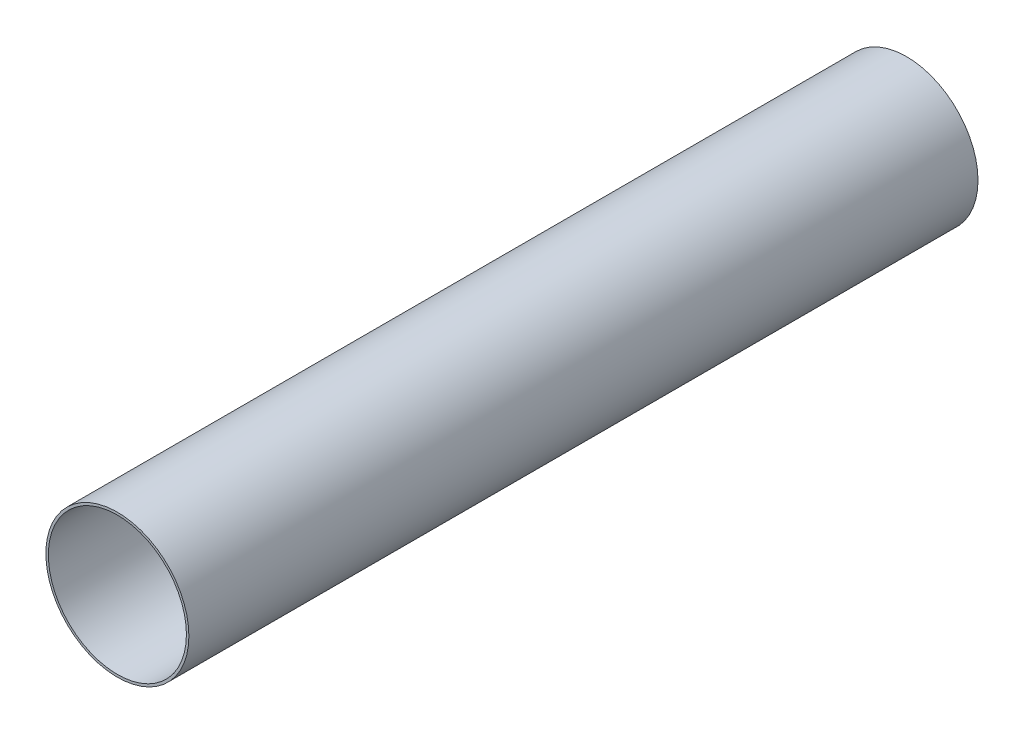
from build123d import *

# Parameters (mm, degrees)
SKETCH1_R      = 23.01875
SKETCH1_R_2    = 22.225
EXTRUDE1_DEPTH = 254


with BuildPart() as part:
    # Sketch1 → Extrude1 (new body)
    with BuildSketch(Plane.XY):
        Circle(SKETCH1_R)
        Circle(SKETCH1_R_2, mode=Mode.SUBTRACT)
    extrude(amount=EXTRUDE1_DEPTH)


solid = part.part
